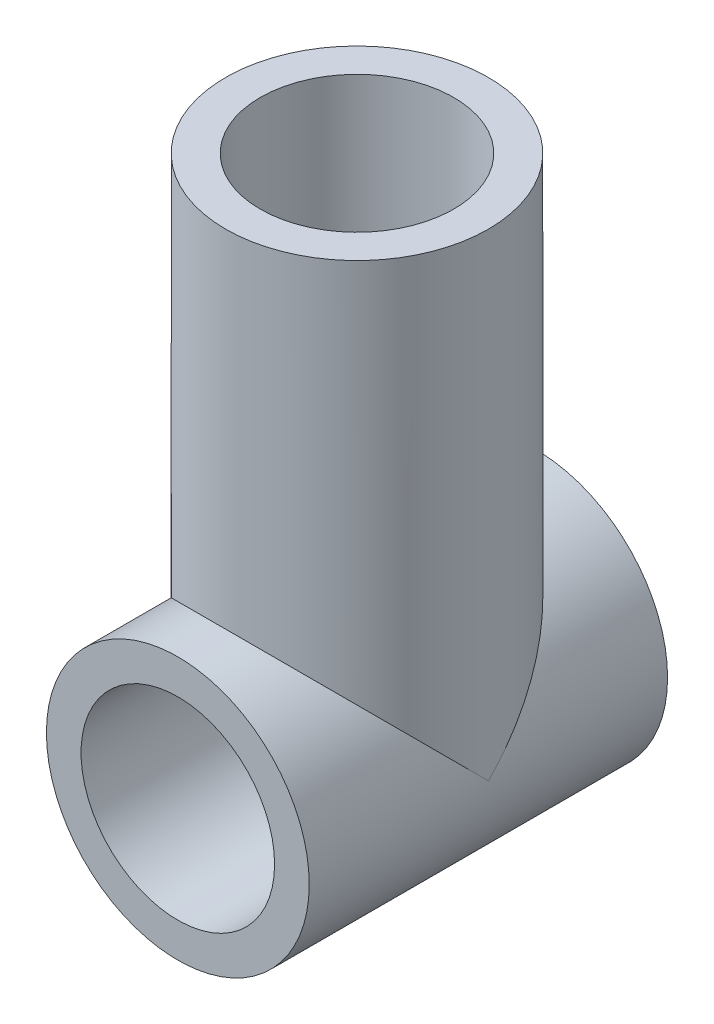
from build123d import *

# Parameters (mm, degrees)
SKETCH_1_R          = 11
EXTRUDE_1_DEPTH     = 30
SKETCH_2_R          = 11
SKETCH_2_R_2        = 8.1
EXTRUDE_2_DEPTH     = 40
SKETCH_3_R          = 8.1
CUT_EXTRUDE_1_DEPTH = 52.195703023
CUT_EXTRUDE_START   = -40
SKETCH_5_R          = 8.1
CUT_EXTRUDE_3_DEPTH = 40


with BuildPart() as part:
    # Sketch 1 → Extrude 1 (new body)
    with BuildSketch(Plane.XY):
        Circle(SKETCH_1_R)
    extrude(amount=EXTRUDE_1_DEPTH)

    # Sketch 2 → Extrude 2 (add)
    with BuildSketch(Plane(origin=(0, 0, 0), x_dir=(1, 0, 0), z_dir=(0, 1, 0))):
        with Locations((0, -15)):
            Circle(SKETCH_2_R)
        with Locations(Location((0, -15, 0), (0, 0, 90))):
            Circle(SKETCH_2_R_2, mode=Mode.SUBTRACT)
    extrude(amount=EXTRUDE_2_DEPTH)

    # Sketch 3 → Cut-Extrude 1 (cut, through all)
    with BuildSketch(Plane.XY.offset(30)):
        Circle(SKETCH_3_R)
    extrude(amount=-CUT_EXTRUDE_1_DEPTH, mode=Mode.SUBTRACT)

    # Sketch 5 → Cut-Extrude 3 (cut)
    with BuildSketch(Plane(origin=(0, 40, 0), x_dir=(1, 0, 0), z_dir=(0, 1, 0)).offset(CUT_EXTRUDE_START)):
        with Locations(Location((0, -15, 0), (0, 0, 180))):
            Circle(SKETCH_5_R)
    extrude(amount=CUT_EXTRUDE_3_DEPTH, mode=Mode.SUBTRACT)


solid = part.part
